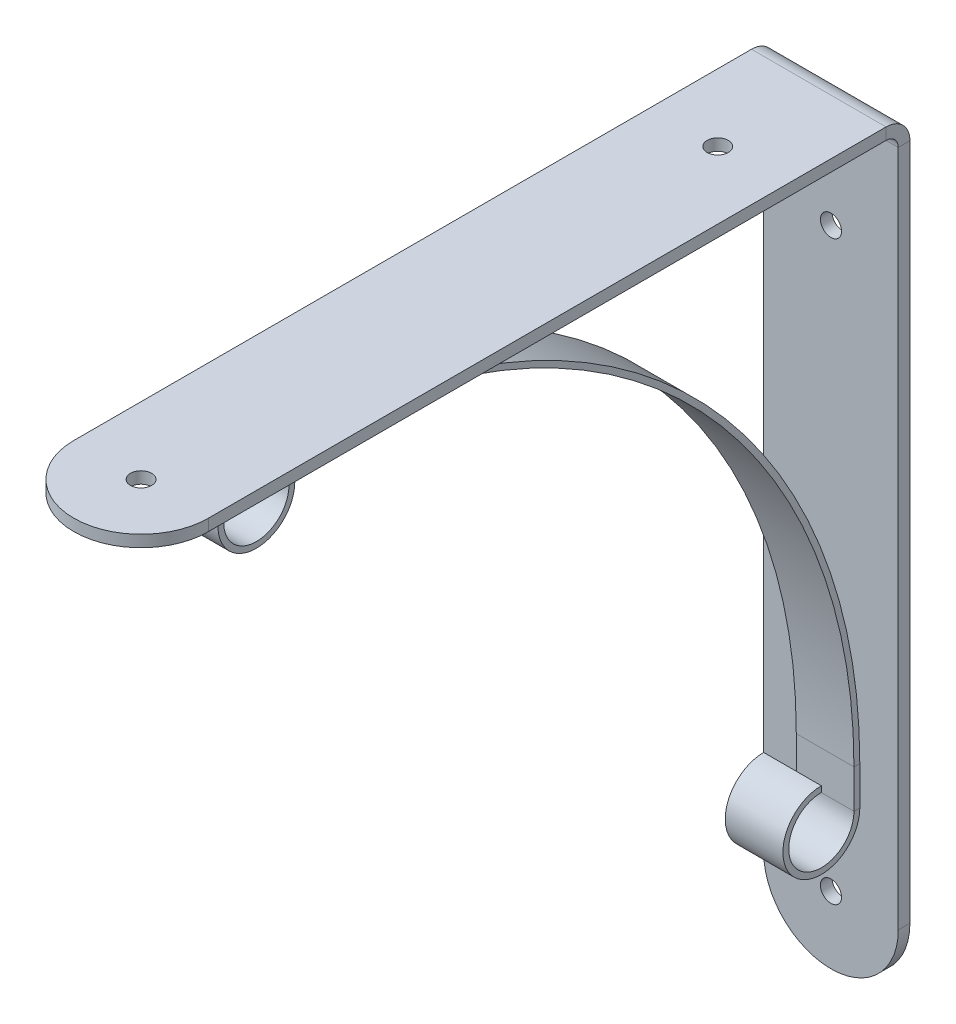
ISO-10303-21;
HEADER;
FILE_DESCRIPTION(('STEP AP214'),'2;1');
FILE_NAME('part.step','',(''),(''),'','','');
FILE_SCHEMA(('AUTOMOTIVE_DESIGN { 1 0 10303 214 1 1 1 1 }'));
ENDSEC;
DATA;
#1=APPLICATION_CONTEXT('core data for automotive mechanical design processes');
#2=APPLICATION_PROTOCOL_DEFINITION('international standard','automotive_design',2000,#1);
#3=PRODUCT_CONTEXT('',#1,'mechanical');
#4=PRODUCT('Part','Part','',(#3));
#5=PRODUCT_RELATED_PRODUCT_CATEGORY('part','',(#4));
#6=PRODUCT_DEFINITION_FORMATION('','',#4);
#7=PRODUCT_DEFINITION_CONTEXT('part definition',#1,'design');
#8=PRODUCT_DEFINITION('design','',#6,#7);
#9=PRODUCT_DEFINITION_SHAPE('','',#8);
#10=(LENGTH_UNIT() NAMED_UNIT(*) SI_UNIT(.MILLI.,.METRE.));
#11=(NAMED_UNIT(*) PLANE_ANGLE_UNIT() SI_UNIT($,.RADIAN.));
#12=(NAMED_UNIT(*) SI_UNIT($,.STERADIAN.) SOLID_ANGLE_UNIT());
#13=UNCERTAINTY_MEASURE_WITH_UNIT(LENGTH_MEASURE(1.E-05),#10,'distance_accuracy_value','');
#14=(GEOMETRIC_REPRESENTATION_CONTEXT(3) GLOBAL_UNCERTAINTY_ASSIGNED_CONTEXT((#13)) GLOBAL_UNIT_ASSIGNED_CONTEXT((#10,
#11,#12)) REPRESENTATION_CONTEXT('',''));
#15=CARTESIAN_POINT('',(0.,0.,0.));
#16=DIRECTION('',(0.,0.,1.));
#17=DIRECTION('',(1.,0.,0.));
#18=AXIS2_PLACEMENT_3D('',#15,#16,#17);
#19=CARTESIAN_POINT('',(7.5,-160.,4.55675999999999));
#20=DIRECTION('',(1.,0.,0.));
#21=DIRECTION('',(0.,0.,-1.));
#22=AXIS2_PLACEMENT_3D('',#19,#20,#21);
#23=PLANE('',#22);
#24=DIRECTION('',(0.,0.,-1.));
#25=VECTOR('',#24,1.);
#26=CARTESIAN_POINT('',(7.5,-160.,4.55675999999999));
#27=LINE('',#26,#25);
#28=CARTESIAN_POINT('',(7.5,-160.,4.55675999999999));
#29=VERTEX_POINT('',#28);
#30=CARTESIAN_POINT('',(7.5,-160.,3.03783999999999));
#31=VERTEX_POINT('',#30);
#32=EDGE_CURVE('E12',#29,#31,#27,.T.);
#33=ORIENTED_EDGE('',*,*,#32,.F.);
#34=CARTESIAN_POINT('',(7.5,-160.,13.03784));
#35=DIRECTION('',(1.,0.,0.));
#36=DIRECTION('',(0.,0.,-1.));
#37=AXIS2_PLACEMENT_3D('',#34,#35,#36);
#38=CIRCLE('',#37,8.48108000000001);
#39=CARTESIAN_POINT('',(7.5,-151.51892,13.03784));
#40=VERTEX_POINT('',#39);
#41=EDGE_CURVE('E298',#40,#29,#38,.T.);
#42=ORIENTED_EDGE('',*,*,#41,.F.);
#43=DIRECTION('',(0.,-1.,0.));
#44=VECTOR('',#43,1.);
#45=CARTESIAN_POINT('',(7.5,-150.,13.03784));
#46=LINE('',#45,#44);
#47=CARTESIAN_POINT('',(7.5,-150.,13.03784));
#48=VERTEX_POINT('',#47);
#49=EDGE_CURVE('E309',#48,#40,#46,.T.);
#50=ORIENTED_EDGE('',*,*,#49,.F.);
#51=CARTESIAN_POINT('',(7.5,-160.,13.03784));
#52=DIRECTION('',(1.,0.,0.));
#53=DIRECTION('',(0.,0.,1.));
#54=AXIS2_PLACEMENT_3D('',#51,#52,#53);
#55=CIRCLE('',#54,10.);
#56=EDGE_CURVE('E173',#48,#31,#55,.T.);
#57=ORIENTED_EDGE('',*,*,#56,.T.);
#58=EDGE_LOOP('',(#33,#42,#50,#57));
#59=FACE_BOUND('',#58,.T.);
#60=ADVANCED_FACE('F52',(#59),#23,.T.);
#61=CARTESIAN_POINT('',(-7.5,-160.,3.03783999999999));
#62=DIRECTION('',(-1.,0.,0.));
#63=DIRECTION('',(0.,0.,1.));
#64=AXIS2_PLACEMENT_3D('',#61,#62,#63);
#65=PLANE('',#64);
#66=DIRECTION('',(0.,0.,1.));
#67=VECTOR('',#66,1.);
#68=CARTESIAN_POINT('',(-7.5,-160.,3.03783999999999));
#69=LINE('',#68,#67);
#70=CARTESIAN_POINT('',(-7.5,-160.,3.03783999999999));
#71=VERTEX_POINT('',#70);
#72=CARTESIAN_POINT('',(-7.5,-160.,4.55675999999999));
#73=VERTEX_POINT('',#72);
#74=EDGE_CURVE('E61',#71,#73,#69,.T.);
#75=ORIENTED_EDGE('',*,*,#74,.F.);
#76=CARTESIAN_POINT('',(-7.5,-160.,13.03784));
#77=DIRECTION('',(1.,0.,0.));
#78=DIRECTION('',(0.,0.,1.));
#79=AXIS2_PLACEMENT_3D('',#76,#77,#78);
#80=CIRCLE('',#79,10.);
#81=CARTESIAN_POINT('',(-7.5,-150.,13.03784));
#82=VERTEX_POINT('',#81);
#83=EDGE_CURVE('E228',#82,#71,#80,.T.);
#84=ORIENTED_EDGE('',*,*,#83,.F.);
#85=DIRECTION('',(0.,-1.,0.));
#86=VECTOR('',#85,1.);
#87=CARTESIAN_POINT('',(-7.5,-150.,13.03784));
#88=LINE('',#87,#86);
#89=CARTESIAN_POINT('',(-7.5,-151.51892,13.03784));
#90=VERTEX_POINT('',#89);
#91=EDGE_CURVE('E224',#82,#90,#88,.T.);
#92=ORIENTED_EDGE('',*,*,#91,.T.);
#93=CARTESIAN_POINT('',(-7.5,-160.,13.03784));
#94=DIRECTION('',(1.,0.,0.));
#95=DIRECTION('',(0.,0.,-1.));
#96=AXIS2_PLACEMENT_3D('',#93,#94,#95);
#97=CIRCLE('',#96,8.48108000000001);
#98=EDGE_CURVE('E220',#90,#73,#97,.T.);
#99=ORIENTED_EDGE('',*,*,#98,.T.);
#100=EDGE_LOOP('',(#75,#84,#92,#99));
#101=FACE_BOUND('',#100,.T.);
#102=ADVANCED_FACE('F302',(#101),#65,.T.);
#103=CARTESIAN_POINT('',(7.5,-150.,3.03783999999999));
#104=DIRECTION('',(1.,0.,0.));
#105=DIRECTION('',(0.,0.,-1.));
#106=AXIS2_PLACEMENT_3D('',#103,#104,#105);
#107=PLANE('',#106);
#108=DIRECTION('',(0.,0.,1.));
#109=VECTOR('',#108,1.);
#110=CARTESIAN_POINT('',(7.5,-150.,3.03783999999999));
#111=LINE('',#110,#109);
#112=CARTESIAN_POINT('',(7.5,-150.,3.03783999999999));
#113=VERTEX_POINT('',#112);
#114=CARTESIAN_POINT('',(7.5,-150.,4.55675999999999));
#115=VERTEX_POINT('',#114);
#116=EDGE_CURVE('E150',#113,#115,#111,.T.);
#117=ORIENTED_EDGE('',*,*,#116,.F.);
#118=CARTESIAN_POINT('',(7.5,-150.,150.));
#119=DIRECTION('',(1.,0.,0.));
#120=DIRECTION('',(0.,0.,1.));
#121=AXIS2_PLACEMENT_3D('',#118,#119,#120);
#122=CIRCLE('',#121,146.96216);
#123=CARTESIAN_POINT('',(7.5,-3.03783999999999,150.));
#124=VERTEX_POINT('',#123);
#125=EDGE_CURVE('E154',#113,#124,#122,.T.);
#126=ORIENTED_EDGE('',*,*,#125,.T.);
#127=DIRECTION('',(0.,1.,0.));
#128=VECTOR('',#127,1.);
#129=CARTESIAN_POINT('',(7.5,-4.55675999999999,150.));
#130=LINE('',#129,#128);
#131=CARTESIAN_POINT('',(7.5,-4.55675999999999,150.));
#132=VERTEX_POINT('',#131);
#133=EDGE_CURVE('E163',#132,#124,#130,.T.);
#134=ORIENTED_EDGE('',*,*,#133,.F.);
#135=CARTESIAN_POINT('',(7.5,-150.,150.));
#136=DIRECTION('',(1.,0.,0.));
#137=DIRECTION('',(0.,0.,-1.));
#138=AXIS2_PLACEMENT_3D('',#135,#136,#137);
#139=CIRCLE('',#138,145.44324);
#140=EDGE_CURVE('E157',#115,#132,#139,.T.);
#141=ORIENTED_EDGE('',*,*,#140,.F.);
#142=EDGE_LOOP('',(#117,#126,#134,#141));
#143=FACE_BOUND('',#142,.T.);
#144=ADVANCED_FACE('F152',(#143),#107,.T.);
#145=CARTESIAN_POINT('',(7.5,-4.55675999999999,150.));
#146=DIRECTION('',(1.,0.,0.));
#147=DIRECTION('',(0.,0.,-1.));
#148=AXIS2_PLACEMENT_3D('',#145,#146,#147);
#149=PLANE('',#148);
#150=DIRECTION('',(0.,1.,0.));
#151=VECTOR('',#150,1.);
#152=CARTESIAN_POINT('',(7.5,-150.,3.03783999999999));
#153=LINE('',#152,#151);
#154=EDGE_CURVE('E166',#31,#113,#153,.T.);
#155=ORIENTED_EDGE('',*,*,#154,.T.);
#156=ORIENTED_EDGE('',*,*,#116,.T.);
#157=DIRECTION('',(0.,1.,0.));
#158=VECTOR('',#157,1.);
#159=CARTESIAN_POINT('',(7.5,-150.,4.55675999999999));
#160=LINE('',#159,#158);
#161=EDGE_CURVE('E312',#29,#115,#160,.T.);
#162=ORIENTED_EDGE('',*,*,#161,.F.);
#163=ORIENTED_EDGE('',*,*,#32,.T.);
#164=EDGE_LOOP('',(#155,#156,#162,#163));
#165=FACE_BOUND('',#164,.T.);
#166=ADVANCED_FACE('F168',(#165),#149,.T.);
#167=CARTESIAN_POINT('',(-7.5,-3.03783999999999,150.));
#168=DIRECTION('',(-1.,0.,0.));
#169=DIRECTION('',(0.,0.,1.));
#170=AXIS2_PLACEMENT_3D('',#167,#168,#169);
#171=PLANE('',#170);
#172=DIRECTION('',(0.,-1.,0.));
#173=VECTOR('',#172,1.);
#174=CARTESIAN_POINT('',(-7.5,-3.03783999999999,150.));
#175=LINE('',#174,#173);
#176=CARTESIAN_POINT('',(-7.5,-3.03783999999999,150.));
#177=VERTEX_POINT('',#176);
#178=CARTESIAN_POINT('',(-7.5,-4.55675999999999,150.));
#179=VERTEX_POINT('',#178);
#180=EDGE_CURVE('E110',#177,#179,#175,.T.);
#181=ORIENTED_EDGE('',*,*,#180,.F.);
#182=CARTESIAN_POINT('',(-7.5,-150.,150.));
#183=DIRECTION('',(1.,0.,0.));
#184=DIRECTION('',(0.,0.,1.));
#185=AXIS2_PLACEMENT_3D('',#182,#183,#184);
#186=CIRCLE('',#185,146.96216);
#187=CARTESIAN_POINT('',(-7.5,-150.,3.03783999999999));
#188=VERTEX_POINT('',#187);
#189=EDGE_CURVE('E234',#188,#177,#186,.T.);
#190=ORIENTED_EDGE('',*,*,#189,.F.);
#191=DIRECTION('',(0.,0.,-1.));
#192=VECTOR('',#191,1.);
#193=CARTESIAN_POINT('',(-7.5,-150.,4.55675999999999));
#194=LINE('',#193,#192);
#195=CARTESIAN_POINT('',(-7.5,-150.,4.55675999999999));
#196=VERTEX_POINT('',#195);
#197=EDGE_CURVE('E279',#196,#188,#194,.T.);
#198=ORIENTED_EDGE('',*,*,#197,.F.);
#199=CARTESIAN_POINT('',(-7.5,-150.,150.));
#200=DIRECTION('',(1.,0.,0.));
#201=DIRECTION('',(0.,0.,-1.));
#202=AXIS2_PLACEMENT_3D('',#199,#200,#201);
#203=CIRCLE('',#202,145.44324);
#204=EDGE_CURVE('E213',#196,#179,#203,.T.);
#205=ORIENTED_EDGE('',*,*,#204,.T.);
#206=EDGE_LOOP('',(#181,#190,#198,#205));
#207=FACE_BOUND('',#206,.T.);
#208=ADVANCED_FACE('F344',(#207),#171,.T.);
#209=CARTESIAN_POINT('',(-7.5,-150.,4.55675999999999));
#210=DIRECTION('',(-1.,0.,0.));
#211=DIRECTION('',(0.,0.,1.));
#212=AXIS2_PLACEMENT_3D('',#209,#210,#211);
#213=PLANE('',#212);
#214=DIRECTION('',(0.,0.,1.));
#215=VECTOR('',#214,1.);
#216=CARTESIAN_POINT('',(-7.5,-3.03784,160.));
#217=LINE('',#216,#215);
#218=CARTESIAN_POINT('',(-7.5,-3.03784,160.));
#219=VERTEX_POINT('',#218);
#220=EDGE_CURVE('E237',#177,#219,#217,.T.);
#221=ORIENTED_EDGE('',*,*,#220,.F.);
#222=ORIENTED_EDGE('',*,*,#180,.T.);
#223=DIRECTION('',(0.,0.,1.));
#224=VECTOR('',#223,1.);
#225=CARTESIAN_POINT('',(-7.5,-4.55675999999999,160.));
#226=LINE('',#225,#224);
#227=CARTESIAN_POINT('',(-7.5,-4.55675999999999,160.));
#228=VERTEX_POINT('',#227);
#229=EDGE_CURVE('E210',#179,#228,#226,.T.);
#230=ORIENTED_EDGE('',*,*,#229,.T.);
#231=DIRECTION('',(0.,1.,0.));
#232=VECTOR('',#231,1.);
#233=CARTESIAN_POINT('',(-7.5,-4.55675999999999,160.));
#234=LINE('',#233,#232);
#235=EDGE_CURVE('E117',#228,#219,#234,.T.);
#236=ORIENTED_EDGE('',*,*,#235,.T.);
#237=EDGE_LOOP('',(#221,#222,#230,#236));
#238=FACE_BOUND('',#237,.T.);
#239=ADVANCED_FACE('F347',(#238),#213,.T.);
#240=CARTESIAN_POINT('',(7.5,-3.03784,160.));
#241=DIRECTION('',(1.,0.,0.));
#242=DIRECTION('',(0.,0.,-1.));
#243=AXIS2_PLACEMENT_3D('',#240,#241,#242);
#244=PLANE('',#243);
#245=DIRECTION('',(0.,-1.,0.));
#246=VECTOR('',#245,1.);
#247=CARTESIAN_POINT('',(7.5,-3.03784,160.));
#248=LINE('',#247,#246);
#249=CARTESIAN_POINT('',(7.5,-3.03784,160.));
#250=VERTEX_POINT('',#249);
#251=CARTESIAN_POINT('',(7.5,-4.55675999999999,160.));
#252=VERTEX_POINT('',#251);
#253=EDGE_CURVE('E69',#250,#252,#248,.T.);
#254=ORIENTED_EDGE('',*,*,#253,.F.);
#255=CARTESIAN_POINT('',(7.5,-13.03784,160.));
#256=DIRECTION('',(1.,0.,0.));
#257=DIRECTION('',(0.,0.,-1.));
#258=AXIS2_PLACEMENT_3D('',#255,#256,#257);
#259=CIRCLE('',#258,10.);
#260=CARTESIAN_POINT('',(7.5,-13.03784,150.));
#261=VERTEX_POINT('',#260);
#262=EDGE_CURVE('E123',#250,#261,#259,.T.);
#263=ORIENTED_EDGE('',*,*,#262,.T.);
#264=DIRECTION('',(0.,0.,-1.));
#265=VECTOR('',#264,1.);
#266=CARTESIAN_POINT('',(7.5,-13.03784,151.51892));
#267=LINE('',#266,#265);
#268=CARTESIAN_POINT('',(7.5,-13.03784,151.51892));
#269=VERTEX_POINT('',#268);
#270=EDGE_CURVE('E612',#269,#261,#267,.T.);
#271=ORIENTED_EDGE('',*,*,#270,.F.);
#272=CARTESIAN_POINT('',(7.5,-13.03784,160.));
#273=DIRECTION('',(1.,0.,0.));
#274=DIRECTION('',(0.,0.,-1.));
#275=AXIS2_PLACEMENT_3D('',#272,#273,#274);
#276=CIRCLE('',#275,8.48108);
#277=EDGE_CURVE('E616',#252,#269,#276,.T.);
#278=ORIENTED_EDGE('',*,*,#277,.F.);
#279=EDGE_LOOP('',(#254,#263,#271,#278));
#280=FACE_BOUND('',#279,.T.);
#281=ADVANCED_FACE('F350',(#280),#244,.T.);
#282=CARTESIAN_POINT('',(-7.5,-4.55675999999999,160.));
#283=DIRECTION('',(-1.,0.,0.));
#284=DIRECTION('',(0.,0.,1.));
#285=AXIS2_PLACEMENT_3D('',#282,#283,#284);
#286=PLANE('',#285);
#287=ORIENTED_EDGE('',*,*,#235,.F.);
#288=CARTESIAN_POINT('',(-7.5,-13.03784,160.));
#289=DIRECTION('',(1.,0.,0.));
#290=DIRECTION('',(0.,0.,-1.));
#291=AXIS2_PLACEMENT_3D('',#288,#289,#290);
#292=CIRCLE('',#291,8.48108);
#293=CARTESIAN_POINT('',(-7.5,-13.03784,151.51892));
#294=VERTEX_POINT('',#293);
#295=EDGE_CURVE('E206',#228,#294,#292,.T.);
#296=ORIENTED_EDGE('',*,*,#295,.T.);
#297=DIRECTION('',(0.,0.,-1.));
#298=VECTOR('',#297,1.);
#299=CARTESIAN_POINT('',(-7.5,-13.03784,151.51892));
#300=LINE('',#299,#298);
#301=CARTESIAN_POINT('',(-7.5,-13.03784,150.));
#302=VERTEX_POINT('',#301);
#303=EDGE_CURVE('E202',#294,#302,#300,.T.);
#304=ORIENTED_EDGE('',*,*,#303,.T.);
#305=CARTESIAN_POINT('',(-7.5,-13.03784,160.));
#306=DIRECTION('',(1.,0.,0.));
#307=DIRECTION('',(0.,0.,-1.));
#308=AXIS2_PLACEMENT_3D('',#305,#306,#307);
#309=CIRCLE('',#308,10.);
#310=EDGE_CURVE('E198',#219,#302,#309,.T.);
#311=ORIENTED_EDGE('',*,*,#310,.F.);
#312=EDGE_LOOP('',(#287,#296,#304,#311));
#313=FACE_BOUND('',#312,.T.);
#314=ADVANCED_FACE('F353',(#313),#286,.T.);
#315=CARTESIAN_POINT('',(7.5,-13.03784,160.));
#316=DIRECTION('',(-1.,0.,0.));
#317=DIRECTION('',(0.,0.,1.));
#318=AXIS2_PLACEMENT_3D('',#315,#316,#317);
#319=CYLINDRICAL_SURFACE('',#318,10.);
#320=ORIENTED_EDGE('',*,*,#310,.T.);
#321=DIRECTION('',(-1.,0.,0.));
#322=VECTOR('',#321,1.);
#323=CARTESIAN_POINT('',(7.5,-13.03784,150.));
#324=LINE('',#323,#322);
#325=EDGE_CURVE('E272',#261,#302,#324,.T.);
#326=ORIENTED_EDGE('',*,*,#325,.F.);
#327=ORIENTED_EDGE('',*,*,#262,.F.);
#328=DIRECTION('',(-1.,0.,0.));
#329=VECTOR('',#328,1.);
#330=CARTESIAN_POINT('',(7.5,-3.03784,160.));
#331=LINE('',#330,#329);
#332=EDGE_CURVE('E194',#250,#219,#331,.T.);
#333=ORIENTED_EDGE('',*,*,#332,.T.);
#334=EDGE_LOOP('',(#320,#326,#327,#333));
#335=FACE_BOUND('',#334,.T.);
#336=ADVANCED_FACE('F356',(#335),#319,.T.);
#337=CARTESIAN_POINT('',(7.5,-13.03784,151.51892));
#338=DIRECTION('',(0.,1.,0.));
#339=DIRECTION('',(0.,0.,1.));
#340=AXIS2_PLACEMENT_3D('',#337,#338,#339);
#341=PLANE('',#340);
#342=ORIENTED_EDGE('',*,*,#303,.F.);
#343=DIRECTION('',(-1.,0.,0.));
#344=VECTOR('',#343,1.);
#345=CARTESIAN_POINT('',(7.5,-13.03784,151.51892));
#346=LINE('',#345,#344);
#347=EDGE_CURVE('E269',#269,#294,#346,.T.);
#348=ORIENTED_EDGE('',*,*,#347,.F.);
#349=ORIENTED_EDGE('',*,*,#270,.T.);
#350=ORIENTED_EDGE('',*,*,#325,.T.);
#351=EDGE_LOOP('',(#342,#348,#349,#350));
#352=FACE_BOUND('',#351,.T.);
#353=ADVANCED_FACE('F360',(#352),#341,.T.);
#354=CARTESIAN_POINT('',(7.5,-13.03784,160.));
#355=DIRECTION('',(-1.,0.,0.));
#356=DIRECTION('',(0.,0.,1.));
#357=AXIS2_PLACEMENT_3D('',#354,#355,#356);
#358=CYLINDRICAL_SURFACE('',#357,8.48108);
#359=ORIENTED_EDGE('',*,*,#295,.F.);
#360=DIRECTION('',(-1.,0.,0.));
#361=VECTOR('',#360,1.);
#362=CARTESIAN_POINT('',(7.5,-4.55675999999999,160.));
#363=LINE('',#362,#361);
#364=EDGE_CURVE('E265',#252,#228,#363,.T.);
#365=ORIENTED_EDGE('',*,*,#364,.F.);
#366=ORIENTED_EDGE('',*,*,#277,.T.);
#367=ORIENTED_EDGE('',*,*,#347,.T.);
#368=EDGE_LOOP('',(#359,#365,#366,#367));
#369=FACE_BOUND('',#368,.T.);
#370=ADVANCED_FACE('F364',(#369),#358,.F.);
#371=CARTESIAN_POINT('',(7.5,-4.55675999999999,160.));
#372=DIRECTION('',(0.,-1.,0.));
#373=DIRECTION('',(0.,0.,-1.));
#374=AXIS2_PLACEMENT_3D('',#371,#372,#373);
#375=PLANE('',#374);
#376=ORIENTED_EDGE('',*,*,#229,.F.);
#377=DIRECTION('',(-1.,0.,0.));
#378=VECTOR('',#377,1.);
#379=CARTESIAN_POINT('',(7.5,-4.55675999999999,150.));
#380=LINE('',#379,#378);
#381=EDGE_CURVE('E261',#132,#179,#380,.T.);
#382=ORIENTED_EDGE('',*,*,#381,.F.);
#383=DIRECTION('',(0.,0.,1.));
#384=VECTOR('',#383,1.);
#385=CARTESIAN_POINT('',(7.5,-4.55675999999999,160.));
#386=LINE('',#385,#384);
#387=EDGE_CURVE('E622',#132,#252,#386,.T.);
#388=ORIENTED_EDGE('',*,*,#387,.T.);
#389=ORIENTED_EDGE('',*,*,#364,.T.);
#390=EDGE_LOOP('',(#376,#382,#388,#389));
#391=FACE_BOUND('',#390,.T.);
#392=ADVANCED_FACE('F368',(#391),#375,.T.);
#393=CARTESIAN_POINT('',(7.5,-150.,150.));
#394=DIRECTION('',(-1.,0.,0.));
#395=DIRECTION('',(0.,0.,1.));
#396=AXIS2_PLACEMENT_3D('',#393,#394,#395);
#397=CYLINDRICAL_SURFACE('',#396,145.44324);
#398=ORIENTED_EDGE('',*,*,#204,.F.);
#399=DIRECTION('',(-1.,0.,0.));
#400=VECTOR('',#399,1.);
#401=CARTESIAN_POINT('',(7.5,-150.,4.55675999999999));
#402=LINE('',#401,#400);
#403=EDGE_CURVE('E257',#115,#196,#402,.T.);
#404=ORIENTED_EDGE('',*,*,#403,.F.);
#405=ORIENTED_EDGE('',*,*,#140,.T.);
#406=ORIENTED_EDGE('',*,*,#381,.T.);
#407=EDGE_LOOP('',(#398,#404,#405,#406));
#408=FACE_BOUND('',#407,.T.);
#409=ADVANCED_FACE('F372',(#408),#397,.F.);
#410=CARTESIAN_POINT('',(7.5,-150.,4.55675999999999));
#411=DIRECTION('',(0.,0.,1.));
#412=DIRECTION('',(0.,-1.,0.));
#413=AXIS2_PLACEMENT_3D('',#410,#411,#412);
#414=PLANE('',#413);
#415=DIRECTION('',(0.,1.,0.));
#416=VECTOR('',#415,1.);
#417=CARTESIAN_POINT('',(-7.5,-150.,4.55675999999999));
#418=LINE('',#417,#416);
#419=EDGE_CURVE('E216',#73,#196,#418,.T.);
#420=ORIENTED_EDGE('',*,*,#419,.F.);
#421=DIRECTION('',(-1.,0.,0.));
#422=VECTOR('',#421,1.);
#423=CARTESIAN_POINT('',(7.5,-160.,4.55675999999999));
#424=LINE('',#423,#422);
#425=EDGE_CURVE('E253',#29,#73,#424,.T.);
#426=ORIENTED_EDGE('',*,*,#425,.F.);
#427=ORIENTED_EDGE('',*,*,#161,.T.);
#428=ORIENTED_EDGE('',*,*,#403,.T.);
#429=EDGE_LOOP('',(#420,#426,#427,#428));
#430=FACE_BOUND('',#429,.T.);
#431=ADVANCED_FACE('F300',(#430),#414,.T.);
#432=CARTESIAN_POINT('',(7.5,-160.,13.03784));
#433=DIRECTION('',(-1.,0.,0.));
#434=DIRECTION('',(0.,0.,1.));
#435=AXIS2_PLACEMENT_3D('',#432,#433,#434);
#436=CYLINDRICAL_SURFACE('',#435,8.48108000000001);
#437=ORIENTED_EDGE('',*,*,#98,.F.);
#438=DIRECTION('',(-1.,0.,0.));
#439=VECTOR('',#438,1.);
#440=CARTESIAN_POINT('',(7.5,-151.51892,13.03784));
#441=LINE('',#440,#439);
#442=EDGE_CURVE('E250',#40,#90,#441,.T.);
#443=ORIENTED_EDGE('',*,*,#442,.F.);
#444=ORIENTED_EDGE('',*,*,#41,.T.);
#445=ORIENTED_EDGE('',*,*,#425,.T.);
#446=EDGE_LOOP('',(#437,#443,#444,#445));
#447=FACE_BOUND('',#446,.T.);
#448=ADVANCED_FACE('F296',(#447),#436,.F.);
#449=CARTESIAN_POINT('',(7.5,-150.,13.03784));
#450=DIRECTION('',(0.,0.,-1.));
#451=DIRECTION('',(-1.,0.,0.));
#452=AXIS2_PLACEMENT_3D('',#449,#450,#451);
#453=PLANE('',#452);
#454=ORIENTED_EDGE('',*,*,#91,.F.);
#455=DIRECTION('',(-1.,0.,0.));
#456=VECTOR('',#455,1.);
#457=CARTESIAN_POINT('',(7.5,-150.,13.03784));
#458=LINE('',#457,#456);
#459=EDGE_CURVE('E247',#48,#82,#458,.T.);
#460=ORIENTED_EDGE('',*,*,#459,.F.);
#461=ORIENTED_EDGE('',*,*,#49,.T.);
#462=ORIENTED_EDGE('',*,*,#442,.T.);
#463=EDGE_LOOP('',(#454,#460,#461,#462));
#464=FACE_BOUND('',#463,.T.);
#465=ADVANCED_FACE('F305',(#464),#453,.T.);
#466=CARTESIAN_POINT('',(7.5,-160.,13.03784));
#467=DIRECTION('',(-1.,0.,0.));
#468=DIRECTION('',(0.,0.,1.));
#469=AXIS2_PLACEMENT_3D('',#466,#467,#468);
#470=CYLINDRICAL_SURFACE('',#469,10.);
#471=ORIENTED_EDGE('',*,*,#83,.T.);
#472=DIRECTION('',(-1.,0.,0.));
#473=VECTOR('',#472,1.);
#474=CARTESIAN_POINT('',(7.5,-160.,3.03783999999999));
#475=LINE('',#474,#473);
#476=EDGE_CURVE('E183',#31,#71,#475,.T.);
#477=ORIENTED_EDGE('',*,*,#476,.F.);
#478=ORIENTED_EDGE('',*,*,#56,.F.);
#479=ORIENTED_EDGE('',*,*,#459,.T.);
#480=EDGE_LOOP('',(#471,#477,#478,#479));
#481=FACE_BOUND('',#480,.T.);
#482=ADVANCED_FACE('F324',(#481),#470,.T.);
#483=CARTESIAN_POINT('',(7.5,-150.,3.03783999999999));
#484=DIRECTION('',(0.,0.,1.));
#485=DIRECTION('',(0.,-1.,0.));
#486=AXIS2_PLACEMENT_3D('',#483,#484,#485);
#487=PLANE('',#486);
#488=DIRECTION('',(0.,1.,0.));
#489=VECTOR('',#488,1.);
#490=CARTESIAN_POINT('',(-7.5,-150.,3.03783999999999));
#491=LINE('',#490,#489);
#492=EDGE_CURVE('E180',#71,#188,#491,.T.);
#493=ORIENTED_EDGE('',*,*,#492,.T.);
#494=DIRECTION('',(-1.,0.,0.));
#495=VECTOR('',#494,1.);
#496=CARTESIAN_POINT('',(7.5,-150.,3.03783999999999));
#497=LINE('',#496,#495);
#498=EDGE_CURVE('E177',#113,#188,#497,.T.);
#499=ORIENTED_EDGE('',*,*,#498,.F.);
#500=ORIENTED_EDGE('',*,*,#154,.F.);
#501=ORIENTED_EDGE('',*,*,#476,.T.);
#502=EDGE_LOOP('',(#493,#499,#500,#501));
#503=FACE_BOUND('',#502,.T.);
#504=ADVANCED_FACE('F178',(#503),#487,.F.);
#505=CARTESIAN_POINT('',(7.5,-150.,150.));
#506=DIRECTION('',(-1.,0.,0.));
#507=DIRECTION('',(0.,0.,1.));
#508=AXIS2_PLACEMENT_3D('',#505,#506,#507);
#509=CYLINDRICAL_SURFACE('',#508,146.96216);
#510=ORIENTED_EDGE('',*,*,#189,.T.);
#511=DIRECTION('',(-1.,0.,0.));
#512=VECTOR('',#511,1.);
#513=CARTESIAN_POINT('',(7.5,-3.03783999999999,150.));
#514=LINE('',#513,#512);
#515=EDGE_CURVE('E184',#124,#177,#514,.T.);
#516=ORIENTED_EDGE('',*,*,#515,.F.);
#517=ORIENTED_EDGE('',*,*,#125,.F.);
#518=ORIENTED_EDGE('',*,*,#498,.T.);
#519=EDGE_LOOP('',(#510,#516,#517,#518));
#520=FACE_BOUND('',#519,.T.);
#521=ADVANCED_FACE('F186',(#520),#509,.T.);
#522=CARTESIAN_POINT('',(7.5,-3.03784,160.));
#523=DIRECTION('',(0.,-1.,0.));
#524=DIRECTION('',(0.,0.,-1.));
#525=AXIS2_PLACEMENT_3D('',#522,#523,#524);
#526=PLANE('',#525);
#527=ORIENTED_EDGE('',*,*,#220,.T.);
#528=ORIENTED_EDGE('',*,*,#332,.F.);
#529=DIRECTION('',(0.,0.,1.));
#530=VECTOR('',#529,1.);
#531=CARTESIAN_POINT('',(7.5,-3.03784,160.));
#532=LINE('',#531,#530);
#533=EDGE_CURVE('E190',#124,#250,#532,.T.);
#534=ORIENTED_EDGE('',*,*,#533,.F.);
#535=ORIENTED_EDGE('',*,*,#515,.T.);
#536=EDGE_LOOP('',(#527,#528,#534,#535));
#537=FACE_BOUND('',#536,.T.);
#538=ADVANCED_FACE('F407',(#537),#526,.F.);
#539=CARTESIAN_POINT('',(7.5,-13.03784,160.));
#540=DIRECTION('',(1.,0.,0.));
#541=DIRECTION('',(0.,0.,-1.));
#542=AXIS2_PLACEMENT_3D('',#539,#540,#541);
#543=PLANE('',#542);
#544=ORIENTED_EDGE('',*,*,#533,.T.);
#545=ORIENTED_EDGE('',*,*,#253,.T.);
#546=ORIENTED_EDGE('',*,*,#387,.F.);
#547=ORIENTED_EDGE('',*,*,#133,.T.);
#548=EDGE_LOOP('',(#544,#545,#546,#547));
#549=FACE_BOUND('',#548,.T.);
#550=ADVANCED_FACE('F416',(#549),#543,.T.);
#551=CARTESIAN_POINT('',(-7.5,-13.03784,160.));
#552=DIRECTION('',(1.,0.,0.));
#553=DIRECTION('',(0.,0.,-1.));
#554=AXIS2_PLACEMENT_3D('',#551,#552,#553);
#555=PLANE('',#554);
#556=ORIENTED_EDGE('',*,*,#419,.T.);
#557=ORIENTED_EDGE('',*,*,#197,.T.);
#558=ORIENTED_EDGE('',*,*,#492,.F.);
#559=ORIENTED_EDGE('',*,*,#74,.T.);
#560=EDGE_LOOP('',(#556,#557,#558,#559));
#561=FACE_BOUND('',#560,.T.);
#562=ADVANCED_FACE('F288',(#561),#555,.F.);
#563=CLOSED_SHELL('',(#60,#102,#144,#166,#208,#239,#281,#314,#336,#353,#370,#392,#409,#431,#448,
#465,#482,#504,#521,#538,#550,#562));
#564=MANIFOLD_SOLID_BREP('B2',#563);
#565=CARTESIAN_POINT('',(17.5,-6.21284,0.));
#566=DIRECTION('',(1.,0.,0.));
#567=DIRECTION('',(0.,0.,-1.));
#568=AXIS2_PLACEMENT_3D('',#565,#566,#567);
#569=PLANE('',#568);
#570=DIRECTION('',(0.,0.,1.));
#571=VECTOR('',#570,1.);
#572=CARTESIAN_POINT('',(17.5,-6.21284,0.));
#573=LINE('',#572,#571);
#574=CARTESIAN_POINT('',(17.5,-6.21284,0.));
#575=VERTEX_POINT('',#574);
#576=CARTESIAN_POINT('',(17.5,-6.21284,3.03784));
#577=VERTEX_POINT('',#576);
#578=EDGE_CURVE('E50',#575,#577,#573,.T.);
#579=ORIENTED_EDGE('',*,*,#578,.F.);
#580=CARTESIAN_POINT('',(17.5,-6.21284,6.21284000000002));
#581=DIRECTION('',(1.,0.,0.));
#582=DIRECTION('',(0.,0.,-1.));
#583=AXIS2_PLACEMENT_3D('',#580,#581,#582);
#584=CIRCLE('',#583,6.21284);
#585=CARTESIAN_POINT('',(17.5,0.,6.21284000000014));
#586=VERTEX_POINT('',#585);
#587=EDGE_CURVE('E809',#586,#575,#584,.F.);
#588=ORIENTED_EDGE('',*,*,#587,.F.);
#589=DIRECTION('',(0.,1.,0.));
#590=VECTOR('',#589,1.);
#591=CARTESIAN_POINT('',(17.5,-3.03784,6.21284000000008));
#592=LINE('',#591,#590);
#593=CARTESIAN_POINT('',(17.5,-3.03784,6.21284000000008));
#594=VERTEX_POINT('',#593);
#595=EDGE_CURVE('E680',#594,#586,#592,.T.);
#596=ORIENTED_EDGE('',*,*,#595,.F.);
#597=CARTESIAN_POINT('',(17.5,-6.21284,6.21284000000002));
#598=DIRECTION('',(1.,0.,0.));
#599=DIRECTION('',(0.,0.,-1.));
#600=AXIS2_PLACEMENT_3D('',#597,#598,#599);
#601=CIRCLE('',#600,3.175);
#602=EDGE_CURVE('E745',#594,#577,#601,.F.);
#603=ORIENTED_EDGE('',*,*,#602,.T.);
#604=EDGE_LOOP('',(#579,#588,#596,#603));
#605=FACE_BOUND('',#604,.T.);
#606=ADVANCED_FACE('F671',(#605),#569,.T.);
#607=CARTESIAN_POINT('',(17.5,-3.03784,6.21284000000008));
#608=DIRECTION('',(1.,0.,0.));
#609=DIRECTION('',(0.,0.,-1.));
#610=AXIS2_PLACEMENT_3D('',#607,#608,#609);
#611=PLANE('',#610);
#612=DIRECTION('',(0.,-1.,0.));
#613=VECTOR('',#612,1.);
#614=CARTESIAN_POINT('',(17.5,0.,0.));
#615=LINE('',#614,#613);
#616=CARTESIAN_POINT('',(17.5,-182.5,0.));
#617=VERTEX_POINT('',#616);
#618=EDGE_CURVE('E805',#575,#617,#615,.T.);
#619=ORIENTED_EDGE('',*,*,#618,.F.);
#620=ORIENTED_EDGE('',*,*,#578,.T.);
#621=DIRECTION('',(0.,-1.,0.));
#622=VECTOR('',#621,1.);
#623=CARTESIAN_POINT('',(17.5,0.,3.03784));
#624=LINE('',#623,#622);
#625=CARTESIAN_POINT('',(17.5,-182.5,3.03783999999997));
#626=VERTEX_POINT('',#625);
#627=EDGE_CURVE('E797',#577,#626,#624,.T.);
#628=ORIENTED_EDGE('',*,*,#627,.T.);
#629=DIRECTION('',(0.,0.,1.));
#630=VECTOR('',#629,1.);
#631=CARTESIAN_POINT('',(17.5,-182.5,0.));
#632=LINE('',#631,#630);
#633=EDGE_CURVE('E800',#617,#626,#632,.T.);
#634=ORIENTED_EDGE('',*,*,#633,.F.);
#635=EDGE_LOOP('',(#619,#620,#628,#634));
#636=FACE_BOUND('',#635,.T.);
#637=ADVANCED_FACE('F880',(#636),#611,.T.);
#638=CARTESIAN_POINT('',(-17.5,0.,6.21284000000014));
#639=DIRECTION('',(-1.,0.,0.));
#640=DIRECTION('',(0.,0.,1.));
#641=AXIS2_PLACEMENT_3D('',#638,#639,#640);
#642=PLANE('',#641);
#643=DIRECTION('',(0.,-1.,0.));
#644=VECTOR('',#643,1.);
#645=CARTESIAN_POINT('',(-17.5,0.,6.21284000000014));
#646=LINE('',#645,#644);
#647=CARTESIAN_POINT('',(-17.5,0.,6.21284000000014));
#648=VERTEX_POINT('',#647);
#649=CARTESIAN_POINT('',(-17.5,-3.03784,6.21284000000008));
#650=VERTEX_POINT('',#649);
#651=EDGE_CURVE('E712',#648,#650,#646,.T.);
#652=ORIENTED_EDGE('',*,*,#651,.F.);
#653=CARTESIAN_POINT('',(-17.5,-6.21284,6.21284000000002));
#654=DIRECTION('',(1.,0.,0.));
#655=DIRECTION('',(0.,0.,-1.));
#656=AXIS2_PLACEMENT_3D('',#653,#654,#655);
#657=CIRCLE('',#656,6.21284);
#658=CARTESIAN_POINT('',(-17.5,-6.21284,0.));
#659=VERTEX_POINT('',#658);
#660=EDGE_CURVE('E829',#648,#659,#657,.F.);
#661=ORIENTED_EDGE('',*,*,#660,.T.);
#662=DIRECTION('',(0.,0.,-1.));
#663=VECTOR('',#662,1.);
#664=CARTESIAN_POINT('',(-17.5,-6.21284,3.03784));
#665=LINE('',#664,#663);
#666=CARTESIAN_POINT('',(-17.5,-6.21284,3.03784));
#667=VERTEX_POINT('',#666);
#668=EDGE_CURVE('E719',#667,#659,#665,.T.);
#669=ORIENTED_EDGE('',*,*,#668,.F.);
#670=CARTESIAN_POINT('',(-17.5,-6.21284,6.21284000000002));
#671=DIRECTION('',(1.,0.,0.));
#672=DIRECTION('',(0.,0.,-1.));
#673=AXIS2_PLACEMENT_3D('',#670,#671,#672);
#674=CIRCLE('',#673,3.175);
#675=EDGE_CURVE('E801',#650,#667,#674,.F.);
#676=ORIENTED_EDGE('',*,*,#675,.F.);
#677=EDGE_LOOP('',(#652,#661,#669,#676));
#678=FACE_BOUND('',#677,.T.);
#679=ADVANCED_FACE('F882',(#678),#642,.T.);
#680=CARTESIAN_POINT('',(-17.5,-6.21284,3.03784));
#681=DIRECTION('',(-1.,0.,0.));
#682=DIRECTION('',(0.,0.,1.));
#683=AXIS2_PLACEMENT_3D('',#680,#681,#682);
#684=PLANE('',#683);
#685=DIRECTION('',(0.,0.,-1.));
#686=VECTOR('',#685,1.);
#687=CARTESIAN_POINT('',(-17.5,0.,182.5));
#688=LINE('',#687,#686);
#689=CARTESIAN_POINT('',(-17.5,0.,182.5));
#690=VERTEX_POINT('',#689);
#691=EDGE_CURVE('E832',#690,#648,#688,.T.);
#692=ORIENTED_EDGE('',*,*,#691,.T.);
#693=ORIENTED_EDGE('',*,*,#651,.T.);
#694=DIRECTION('',(0.,0.,-1.));
#695=VECTOR('',#694,1.);
#696=CARTESIAN_POINT('',(-17.5,-3.03784,182.5));
#697=LINE('',#696,#695);
#698=CARTESIAN_POINT('',(-17.5,-3.03784,182.5));
#699=VERTEX_POINT('',#698);
#700=EDGE_CURVE('E837',#699,#650,#697,.T.);
#701=ORIENTED_EDGE('',*,*,#700,.F.);
#702=DIRECTION('',(0.,1.,0.));
#703=VECTOR('',#702,1.);
#704=CARTESIAN_POINT('',(-17.5,-3.03784,182.5));
#705=LINE('',#704,#703);
#706=EDGE_CURVE('E762',#699,#690,#705,.T.);
#707=ORIENTED_EDGE('',*,*,#706,.T.);
#708=EDGE_LOOP('',(#692,#693,#701,#707));
#709=FACE_BOUND('',#708,.T.);
#710=ADVANCED_FACE('F887',(#709),#684,.T.);
#711=CARTESIAN_POINT('',(17.5,0.,3.03784));
#712=DIRECTION('',(0.,0.,-1.));
#713=DIRECTION('',(0.,1.,0.));
#714=AXIS2_PLACEMENT_3D('',#711,#712,#713);
#715=PLANE('',#714);
#716=CARTESIAN_POINT('',(0.,-182.5,3.03783999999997));
#717=DIRECTION('',(0.,0.,-1.));
#718=DIRECTION('',(0.,1.,0.));
#719=AXIS2_PLACEMENT_3D('',#716,#717,#718);
#720=CIRCLE('',#719,2.75);
#721=CARTESIAN_POINT('',(0.,-179.75,3.03783999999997));
#722=VERTEX_POINT('',#721);
#723=EDGE_CURVE('E771',#722,#722,#720,.T.);
#724=ORIENTED_EDGE('',*,*,#723,.T.);
#725=EDGE_LOOP('',(#724));
#726=FACE_BOUND('',#725,.T.);
#727=CARTESIAN_POINT('',(0.,-32.5,3.03784));
#728=DIRECTION('',(0.,0.,-1.));
#729=DIRECTION('',(0.,1.,0.));
#730=AXIS2_PLACEMENT_3D('',#727,#728,#729);
#731=CIRCLE('',#730,2.75);
#732=CARTESIAN_POINT('',(0.,-29.75,3.03784));
#733=VERTEX_POINT('',#732);
#734=EDGE_CURVE('E785',#733,#733,#731,.T.);
#735=ORIENTED_EDGE('',*,*,#734,.T.);
#736=EDGE_LOOP('',(#735));
#737=FACE_BOUND('',#736,.T.);
#738=DIRECTION('',(0.,-1.,0.));
#739=VECTOR('',#738,1.);
#740=CARTESIAN_POINT('',(-17.5,0.,3.03784));
#741=LINE('',#740,#739);
#742=CARTESIAN_POINT('',(-17.5,-182.5,3.03783999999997));
#743=VERTEX_POINT('',#742);
#744=EDGE_CURVE('E793',#667,#743,#741,.T.);
#745=ORIENTED_EDGE('',*,*,#744,.T.);
#746=CARTESIAN_POINT('',(0.,-182.5,3.03783999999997));
#747=DIRECTION('',(0.,0.,-1.));
#748=DIRECTION('',(0.,1.,0.));
#749=AXIS2_PLACEMENT_3D('',#746,#747,#748);
#750=CIRCLE('',#749,17.5);
#751=EDGE_CURVE('E790',#626,#743,#750,.T.);
#752=ORIENTED_EDGE('',*,*,#751,.F.);
#753=ORIENTED_EDGE('',*,*,#627,.F.);
#754=DIRECTION('',(-1.,0.,0.));
#755=VECTOR('',#754,1.);
#756=CARTESIAN_POINT('',(17.5,-6.21284,3.03784));
#757=LINE('',#756,#755);
#758=EDGE_CURVE('E817',#577,#667,#757,.T.);
#759=ORIENTED_EDGE('',*,*,#758,.T.);
#760=EDGE_LOOP('',(#745,#752,#753,#759));
#761=FACE_BOUND('',#760,.T.);
#762=ADVANCED_FACE('F878',(#726,#737,#761),#715,.F.);
#763=CARTESIAN_POINT('',(17.5,0.,0.));
#764=DIRECTION('',(0.,0.,-1.));
#765=DIRECTION('',(0.,1.,0.));
#766=AXIS2_PLACEMENT_3D('',#763,#764,#765);
#767=PLANE('',#766);
#768=CARTESIAN_POINT('',(0.,-182.5,0.));
#769=DIRECTION('',(0.,0.,-1.));
#770=DIRECTION('',(0.,1.,0.));
#771=AXIS2_PLACEMENT_3D('',#768,#769,#770);
#772=CIRCLE('',#771,2.75);
#773=CARTESIAN_POINT('',(0.,-179.75,0.));
#774=VERTEX_POINT('',#773);
#775=EDGE_CURVE('E764',#774,#774,#772,.T.);
#776=ORIENTED_EDGE('',*,*,#775,.F.);
#777=EDGE_LOOP('',(#776));
#778=FACE_BOUND('',#777,.T.);
#779=CARTESIAN_POINT('',(0.,-32.5,0.));
#780=DIRECTION('',(0.,0.,-1.));
#781=DIRECTION('',(0.,1.,0.));
#782=AXIS2_PLACEMENT_3D('',#779,#780,#781);
#783=CIRCLE('',#782,2.75);
#784=CARTESIAN_POINT('',(0.,-29.75,0.));
#785=VERTEX_POINT('',#784);
#786=EDGE_CURVE('E781',#785,#785,#783,.T.);
#787=ORIENTED_EDGE('',*,*,#786,.F.);
#788=EDGE_LOOP('',(#787));
#789=FACE_BOUND('',#788,.T.);
#790=ORIENTED_EDGE('',*,*,#618,.T.);
#791=CARTESIAN_POINT('',(0.,-182.5,0.));
#792=DIRECTION('',(0.,0.,-1.));
#793=DIRECTION('',(0.,1.,0.));
#794=AXIS2_PLACEMENT_3D('',#791,#792,#793);
#795=CIRCLE('',#794,17.5);
#796=CARTESIAN_POINT('',(-17.5,-182.5,0.));
#797=VERTEX_POINT('',#796);
#798=EDGE_CURVE('E789',#617,#797,#795,.T.);
#799=ORIENTED_EDGE('',*,*,#798,.T.);
#800=DIRECTION('',(0.,-1.,0.));
#801=VECTOR('',#800,1.);
#802=CARTESIAN_POINT('',(-17.5,0.,0.));
#803=LINE('',#802,#801);
#804=EDGE_CURVE('E825',#659,#797,#803,.T.);
#805=ORIENTED_EDGE('',*,*,#804,.F.);
#806=DIRECTION('',(-1.,0.,0.));
#807=VECTOR('',#806,1.);
#808=CARTESIAN_POINT('',(17.5,-6.21284,0.));
#809=LINE('',#808,#807);
#810=EDGE_CURVE('E851',#575,#659,#809,.T.);
#811=ORIENTED_EDGE('',*,*,#810,.F.);
#812=EDGE_LOOP('',(#790,#799,#805,#811));
#813=FACE_BOUND('',#812,.T.);
#814=ADVANCED_FACE('F894',(#778,#789,#813),#767,.T.);
#815=CARTESIAN_POINT('',(17.5,-6.21284,6.21284000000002));
#816=DIRECTION('',(-1.,0.,0.));
#817=DIRECTION('',(0.,0.,1.));
#818=AXIS2_PLACEMENT_3D('',#815,#816,#817);
#819=CYLINDRICAL_SURFACE('',#818,6.21284);
#820=ORIENTED_EDGE('',*,*,#660,.F.);
#821=DIRECTION('',(-1.,0.,0.));
#822=VECTOR('',#821,1.);
#823=CARTESIAN_POINT('',(17.5,0.,6.21284000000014));
#824=LINE('',#823,#822);
#825=EDGE_CURVE('E847',#586,#648,#824,.T.);
#826=ORIENTED_EDGE('',*,*,#825,.F.);
#827=ORIENTED_EDGE('',*,*,#587,.T.);
#828=ORIENTED_EDGE('',*,*,#810,.T.);
#829=EDGE_LOOP('',(#820,#826,#827,#828));
#830=FACE_BOUND('',#829,.T.);
#831=ADVANCED_FACE('F863',(#830),#819,.T.);
#832=CARTESIAN_POINT('',(17.5,0.,182.5));
#833=DIRECTION('',(0.,1.,0.));
#834=DIRECTION('',(0.,0.,1.));
#835=AXIS2_PLACEMENT_3D('',#832,#833,#834);
#836=PLANE('',#835);
#837=CARTESIAN_POINT('',(0.,0.,32.5));
#838=DIRECTION('',(0.,1.,0.));
#839=DIRECTION('',(0.,0.,1.));
#840=AXIS2_PLACEMENT_3D('',#837,#838,#839);
#841=CIRCLE('',#840,2.75);
#842=CARTESIAN_POINT('',(0.,0.,35.25));
#843=VERTEX_POINT('',#842);
#844=EDGE_CURVE('E944',#843,#843,#841,.T.);
#845=ORIENTED_EDGE('',*,*,#844,.F.);
#846=EDGE_LOOP('',(#845));
#847=FACE_BOUND('',#846,.T.);
#848=CARTESIAN_POINT('',(0.,0.,182.5));
#849=DIRECTION('',(0.,1.,0.));
#850=DIRECTION('',(0.,0.,1.));
#851=AXIS2_PLACEMENT_3D('',#848,#849,#850);
#852=CIRCLE('',#851,2.75);
#853=CARTESIAN_POINT('',(0.,0.,185.25));
#854=VERTEX_POINT('',#853);
#855=EDGE_CURVE('E949',#854,#854,#852,.T.);
#856=ORIENTED_EDGE('',*,*,#855,.F.);
#857=EDGE_LOOP('',(#856));
#858=FACE_BOUND('',#857,.T.);
#859=ORIENTED_EDGE('',*,*,#691,.F.);
#860=CARTESIAN_POINT('',(0.,0.,182.5));
#861=DIRECTION('',(0.,1.,0.));
#862=DIRECTION('',(0.,0.,1.));
#863=AXIS2_PLACEMENT_3D('',#860,#861,#862);
#864=CIRCLE('',#863,17.5);
#865=CARTESIAN_POINT('',(17.5,0.,182.5));
#866=VERTEX_POINT('',#865);
#867=EDGE_CURVE('E765',#690,#866,#864,.T.);
#868=ORIENTED_EDGE('',*,*,#867,.T.);
#869=DIRECTION('',(0.,0.,-1.));
#870=VECTOR('',#869,1.);
#871=CARTESIAN_POINT('',(17.5,0.,182.5));
#872=LINE('',#871,#870);
#873=EDGE_CURVE('E753',#866,#586,#872,.T.);
#874=ORIENTED_EDGE('',*,*,#873,.T.);
#875=ORIENTED_EDGE('',*,*,#825,.T.);
#876=EDGE_LOOP('',(#859,#868,#874,#875));
#877=FACE_BOUND('',#876,.T.);
#878=ADVANCED_FACE('F865',(#847,#858,#877),#836,.T.);
#879=CARTESIAN_POINT('',(17.5,-3.03784,182.5));
#880=DIRECTION('',(0.,1.,0.));
#881=DIRECTION('',(0.,0.,1.));
#882=AXIS2_PLACEMENT_3D('',#879,#880,#881);
#883=PLANE('',#882);
#884=CARTESIAN_POINT('',(0.,-3.03784,32.5));
#885=DIRECTION('',(0.,1.,0.));
#886=DIRECTION('',(0.,0.,1.));
#887=AXIS2_PLACEMENT_3D('',#884,#885,#886);
#888=CIRCLE('',#887,2.75);
#889=CARTESIAN_POINT('',(0.,-3.03784,35.25));
#890=VERTEX_POINT('',#889);
#891=EDGE_CURVE('E941',#890,#890,#888,.T.);
#892=ORIENTED_EDGE('',*,*,#891,.T.);
#893=EDGE_LOOP('',(#892));
#894=FACE_BOUND('',#893,.T.);
#895=CARTESIAN_POINT('',(0.,-3.03784,182.5));
#896=DIRECTION('',(0.,1.,0.));
#897=DIRECTION('',(0.,0.,1.));
#898=AXIS2_PLACEMENT_3D('',#895,#896,#897);
#899=CIRCLE('',#898,2.75);
#900=CARTESIAN_POINT('',(0.,-3.03784,185.25));
#901=VERTEX_POINT('',#900);
#902=EDGE_CURVE('E773',#901,#901,#899,.T.);
#903=ORIENTED_EDGE('',*,*,#902,.T.);
#904=EDGE_LOOP('',(#903));
#905=FACE_BOUND('',#904,.T.);
#906=DIRECTION('',(0.,0.,-1.));
#907=VECTOR('',#906,1.);
#908=CARTESIAN_POINT('',(17.5,-3.03784,182.5));
#909=LINE('',#908,#907);
#910=CARTESIAN_POINT('',(17.5,-3.03784,182.5));
#911=VERTEX_POINT('',#910);
#912=EDGE_CURVE('E735',#911,#594,#909,.T.);
#913=ORIENTED_EDGE('',*,*,#912,.F.);
#914=CARTESIAN_POINT('',(0.,-3.03784,182.5));
#915=DIRECTION('',(0.,1.,0.));
#916=DIRECTION('',(0.,0.,1.));
#917=AXIS2_PLACEMENT_3D('',#914,#915,#916);
#918=CIRCLE('',#917,17.5);
#919=EDGE_CURVE('E739',#699,#911,#918,.T.);
#920=ORIENTED_EDGE('',*,*,#919,.F.);
#921=ORIENTED_EDGE('',*,*,#700,.T.);
#922=DIRECTION('',(-1.,0.,0.));
#923=VECTOR('',#922,1.);
#924=CARTESIAN_POINT('',(17.5,-3.03784,6.21284000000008));
#925=LINE('',#924,#923);
#926=EDGE_CURVE('E741',#594,#650,#925,.T.);
#927=ORIENTED_EDGE('',*,*,#926,.F.);
#928=EDGE_LOOP('',(#913,#920,#921,#927));
#929=FACE_BOUND('',#928,.T.);
#930=ADVANCED_FACE('F737',(#894,#905,#929),#883,.F.);
#931=CARTESIAN_POINT('',(17.5,-6.21284,6.21284000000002));
#932=DIRECTION('',(-1.,0.,0.));
#933=DIRECTION('',(0.,0.,1.));
#934=AXIS2_PLACEMENT_3D('',#931,#932,#933);
#935=CYLINDRICAL_SURFACE('',#934,3.175);
#936=ORIENTED_EDGE('',*,*,#675,.T.);
#937=ORIENTED_EDGE('',*,*,#758,.F.);
#938=ORIENTED_EDGE('',*,*,#602,.F.);
#939=ORIENTED_EDGE('',*,*,#926,.T.);
#940=EDGE_LOOP('',(#936,#937,#938,#939));
#941=FACE_BOUND('',#940,.T.);
#942=ADVANCED_FACE('F906',(#941),#935,.F.);
#943=CARTESIAN_POINT('',(17.5,-6.21284,6.21284000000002));
#944=DIRECTION('',(1.,0.,0.));
#945=DIRECTION('',(0.,0.,-1.));
#946=AXIS2_PLACEMENT_3D('',#943,#944,#945);
#947=PLANE('',#946);
#948=ORIENTED_EDGE('',*,*,#912,.T.);
#949=ORIENTED_EDGE('',*,*,#595,.T.);
#950=ORIENTED_EDGE('',*,*,#873,.F.);
#951=DIRECTION('',(0.,1.,0.));
#952=VECTOR('',#951,1.);
#953=CARTESIAN_POINT('',(17.5,-3.03784,182.5));
#954=LINE('',#953,#952);
#955=EDGE_CURVE('E746',#911,#866,#954,.T.);
#956=ORIENTED_EDGE('',*,*,#955,.F.);
#957=EDGE_LOOP('',(#948,#949,#950,#956));
#958=FACE_BOUND('',#957,.T.);
#959=ADVANCED_FACE('F750',(#958),#947,.T.);
#960=CARTESIAN_POINT('',(-17.5,-6.21284,6.21284000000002));
#961=DIRECTION('',(1.,0.,0.));
#962=DIRECTION('',(0.,0.,-1.));
#963=AXIS2_PLACEMENT_3D('',#960,#961,#962);
#964=PLANE('',#963);
#965=ORIENTED_EDGE('',*,*,#744,.F.);
#966=ORIENTED_EDGE('',*,*,#668,.T.);
#967=ORIENTED_EDGE('',*,*,#804,.T.);
#968=DIRECTION('',(0.,0.,1.));
#969=VECTOR('',#968,1.);
#970=CARTESIAN_POINT('',(-17.5,-182.5,0.));
#971=LINE('',#970,#969);
#972=EDGE_CURVE('E821',#797,#743,#971,.T.);
#973=ORIENTED_EDGE('',*,*,#972,.T.);
#974=EDGE_LOOP('',(#965,#966,#967,#973));
#975=FACE_BOUND('',#974,.T.);
#976=ADVANCED_FACE('F911',(#975),#964,.F.);
#977=CARTESIAN_POINT('',(0.,-182.5,3.03783999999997));
#978=DIRECTION('',(0.,0.,-1.));
#979=DIRECTION('',(0.,1.,0.));
#980=AXIS2_PLACEMENT_3D('',#977,#978,#979);
#981=CYLINDRICAL_SURFACE('',#980,17.5);
#982=ORIENTED_EDGE('',*,*,#798,.F.);
#983=ORIENTED_EDGE('',*,*,#633,.T.);
#984=ORIENTED_EDGE('',*,*,#751,.T.);
#985=ORIENTED_EDGE('',*,*,#972,.F.);
#986=EDGE_LOOP('',(#982,#983,#984,#985));
#987=FACE_BOUND('',#986,.T.);
#988=ADVANCED_FACE('F875',(#987),#981,.T.);
#989=CARTESIAN_POINT('',(0.,-32.5,0.));
#990=DIRECTION('',(0.,0.,-1.));
#991=DIRECTION('',(0.,1.,0.));
#992=AXIS2_PLACEMENT_3D('',#989,#990,#991);
#993=CYLINDRICAL_SURFACE('',#992,2.75);
#994=ORIENTED_EDGE('',*,*,#734,.F.);
#995=EDGE_LOOP('',(#994));
#996=FACE_BOUND('',#995,.T.);
#997=ORIENTED_EDGE('',*,*,#786,.T.);
#998=EDGE_LOOP('',(#997));
#999=FACE_BOUND('',#998,.T.);
#1000=ADVANCED_FACE('F919',(#996,#999),#993,.F.);
#1001=CARTESIAN_POINT('',(0.,-182.5,0.));
#1002=DIRECTION('',(0.,0.,-1.));
#1003=DIRECTION('',(0.,1.,0.));
#1004=AXIS2_PLACEMENT_3D('',#1001,#1002,#1003);
#1005=CYLINDRICAL_SURFACE('',#1004,2.75);
#1006=ORIENTED_EDGE('',*,*,#723,.F.);
#1007=EDGE_LOOP('',(#1006));
#1008=FACE_BOUND('',#1007,.T.);
#1009=ORIENTED_EDGE('',*,*,#775,.T.);
#1010=EDGE_LOOP('',(#1009));
#1011=FACE_BOUND('',#1010,.T.);
#1012=ADVANCED_FACE('F922',(#1008,#1011),#1005,.F.);
#1013=CARTESIAN_POINT('',(0.,-3.03784,182.5));
#1014=DIRECTION('',(0.,1.,0.));
#1015=DIRECTION('',(0.,0.,1.));
#1016=AXIS2_PLACEMENT_3D('',#1013,#1014,#1015);
#1017=CYLINDRICAL_SURFACE('',#1016,17.5);
#1018=ORIENTED_EDGE('',*,*,#867,.F.);
#1019=ORIENTED_EDGE('',*,*,#706,.F.);
#1020=ORIENTED_EDGE('',*,*,#919,.T.);
#1021=ORIENTED_EDGE('',*,*,#955,.T.);
#1022=EDGE_LOOP('',(#1018,#1019,#1020,#1021));
#1023=FACE_BOUND('',#1022,.T.);
#1024=ADVANCED_FACE('F760',(#1023),#1017,.T.);
#1025=CARTESIAN_POINT('',(0.,0.,182.5));
#1026=DIRECTION('',(0.,1.,0.));
#1027=DIRECTION('',(0.,0.,1.));
#1028=AXIS2_PLACEMENT_3D('',#1025,#1026,#1027);
#1029=CYLINDRICAL_SURFACE('',#1028,2.75);
#1030=ORIENTED_EDGE('',*,*,#902,.F.);
#1031=EDGE_LOOP('',(#1030));
#1032=FACE_BOUND('',#1031,.T.);
#1033=ORIENTED_EDGE('',*,*,#855,.T.);
#1034=EDGE_LOOP('',(#1033));
#1035=FACE_BOUND('',#1034,.T.);
#1036=ADVANCED_FACE('F929',(#1032,#1035),#1029,.F.);
#1037=CARTESIAN_POINT('',(0.,0.,32.5));
#1038=DIRECTION('',(0.,1.,0.));
#1039=DIRECTION('',(0.,0.,1.));
#1040=AXIS2_PLACEMENT_3D('',#1037,#1038,#1039);
#1041=CYLINDRICAL_SURFACE('',#1040,2.75);
#1042=ORIENTED_EDGE('',*,*,#891,.F.);
#1043=EDGE_LOOP('',(#1042));
#1044=FACE_BOUND('',#1043,.T.);
#1045=ORIENTED_EDGE('',*,*,#844,.T.);
#1046=EDGE_LOOP('',(#1045));
#1047=FACE_BOUND('',#1046,.T.);
#1048=ADVANCED_FACE('F932',(#1044,#1047),#1041,.F.);
#1049=CLOSED_SHELL('',(#606,#637,#679,#710,#762,#814,#831,#878,#930,#942,#959,#976,#988,#1000,
#1012,#1024,#1036,#1048));
#1050=MANIFOLD_SOLID_BREP('B6',#1049);
#1051=ADVANCED_BREP_SHAPE_REPRESENTATION('',(#18,#564,#1050),#14);
#1052=SHAPE_DEFINITION_REPRESENTATION(#9,#1051);
ENDSEC;
END-ISO-10303-21;
